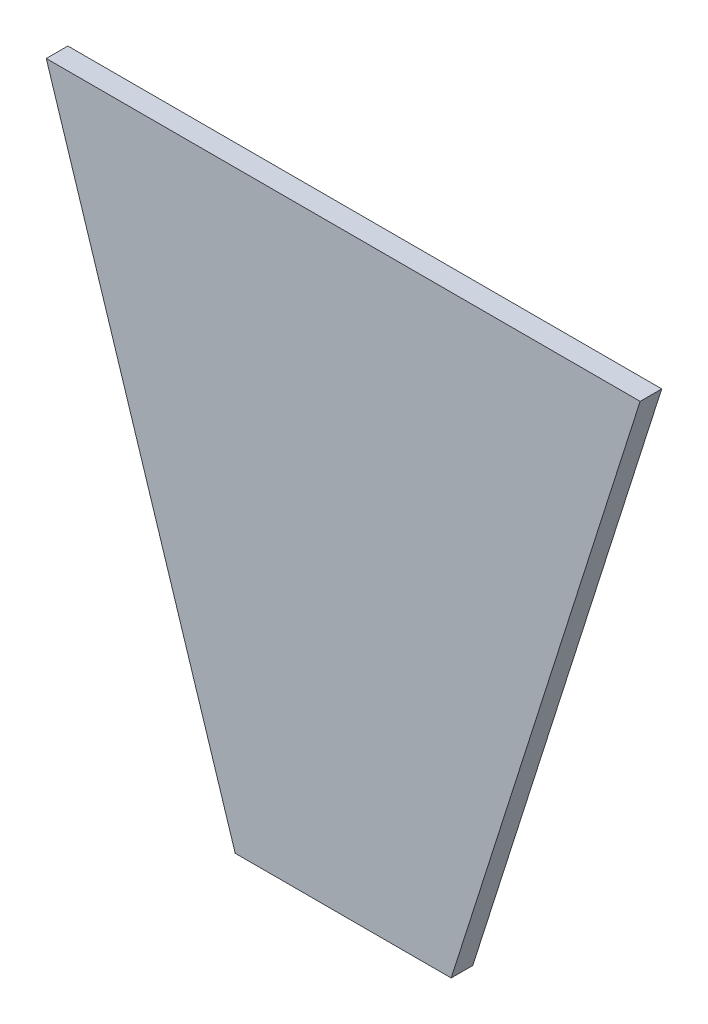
from build123d import *

# Parameters (mm, degrees)
BASE_EXTRUSION_DEPTH = 8


with BuildPart() as part:
    # Esquisse1 → Base-Extrusion (new body)
    with BuildSketch(Plane.XY):
        Polygon((0, 0), (220, 0), (150, -220), (70, -220), align=None)
    extrude(amount=BASE_EXTRUSION_DEPTH)


solid = part.part
